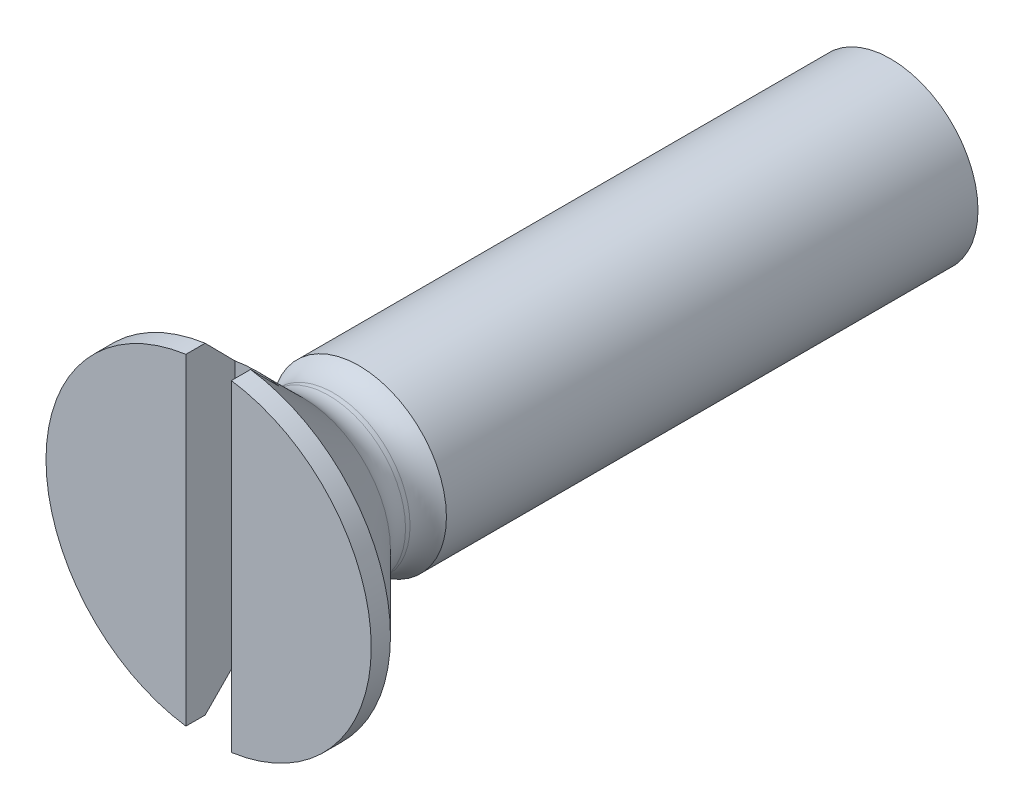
ISO-10303-21;
HEADER;
FILE_DESCRIPTION(('STEP AP214'),'2;1');
FILE_NAME('part.step','',(''),(''),'','','');
FILE_SCHEMA(('AUTOMOTIVE_DESIGN { 1 0 10303 214 1 1 1 1 }'));
ENDSEC;
DATA;
#1=APPLICATION_CONTEXT('core data for automotive mechanical design processes');
#2=APPLICATION_PROTOCOL_DEFINITION('international standard','automotive_design',2000,#1);
#3=PRODUCT_CONTEXT('',#1,'mechanical');
#4=PRODUCT('Part','Part','',(#3));
#5=PRODUCT_RELATED_PRODUCT_CATEGORY('part','',(#4));
#6=PRODUCT_DEFINITION_FORMATION('','',#4);
#7=PRODUCT_DEFINITION_CONTEXT('part definition',#1,'design');
#8=PRODUCT_DEFINITION('design','',#6,#7);
#9=PRODUCT_DEFINITION_SHAPE('','',#8);
#10=(LENGTH_UNIT() NAMED_UNIT(*) SI_UNIT(.MILLI.,.METRE.));
#11=(NAMED_UNIT(*) PLANE_ANGLE_UNIT() SI_UNIT($,.RADIAN.));
#12=(NAMED_UNIT(*) SI_UNIT($,.STERADIAN.) SOLID_ANGLE_UNIT());
#13=UNCERTAINTY_MEASURE_WITH_UNIT(LENGTH_MEASURE(1.E-05),#10,'distance_accuracy_value','');
#14=(GEOMETRIC_REPRESENTATION_CONTEXT(3) GLOBAL_UNCERTAINTY_ASSIGNED_CONTEXT((#13)) GLOBAL_UNIT_ASSIGNED_CONTEXT((#10,
#11,#12)) REPRESENTATION_CONTEXT('',''));
#15=CARTESIAN_POINT('',(0.,0.,0.));
#16=DIRECTION('',(0.,0.,1.));
#17=DIRECTION('',(1.,0.,0.));
#18=AXIS2_PLACEMENT_3D('',#15,#16,#17);
#19=CARTESIAN_POINT('',(0.,0.,0.));
#20=DIRECTION('',(0.,0.,1.));
#21=DIRECTION('',(1.,0.,0.));
#22=AXIS2_PLACEMENT_3D('',#19,#20,#21);
#23=CYLINDRICAL_SURFACE('',#22,2.5);
#24=CARTESIAN_POINT('',(0.,0.,-4.3));
#25=DIRECTION('',(0.,0.,1.));
#26=DIRECTION('',(1.,0.,0.));
#27=AXIS2_PLACEMENT_3D('',#24,#25,#26);
#28=CIRCLE('',#27,2.5);
#29=CARTESIAN_POINT('',(2.5,0.,-4.3));
#30=VERTEX_POINT('',#29);
#31=EDGE_CURVE('E108',#30,#30,#28,.T.);
#32=ORIENTED_EDGE('',*,*,#31,.F.);
#33=EDGE_LOOP('',(#32));
#34=FACE_BOUND('',#33,.T.);
#35=CARTESIAN_POINT('',(0.,0.,-19.5));
#36=DIRECTION('',(0.,0.,1.));
#37=DIRECTION('',(1.,0.,0.));
#38=AXIS2_PLACEMENT_3D('',#35,#36,#37);
#39=CIRCLE('',#38,2.5);
#40=CARTESIAN_POINT('',(2.5,0.,-19.5));
#41=VERTEX_POINT('',#40);
#42=EDGE_CURVE('E32',#41,#41,#39,.T.);
#43=ORIENTED_EDGE('',*,*,#42,.T.);
#44=EDGE_LOOP('',(#43));
#45=FACE_BOUND('',#44,.T.);
#46=ADVANCED_FACE('F29',(#34,#45),#23,.T.);
#47=CARTESIAN_POINT('',(0.,0.,0.));
#48=DIRECTION('',(0.,0.,1.));
#49=DIRECTION('',(1.,0.,0.));
#50=AXIS2_PLACEMENT_3D('',#47,#48,#49);
#51=CYLINDRICAL_SURFACE('',#50,4.65);
#52=CARTESIAN_POINT('',(0.,0.,-0.55));
#53=DIRECTION('',(0.,0.,1.));
#54=DIRECTION('',(1.,0.,0.));
#55=AXIS2_PLACEMENT_3D('',#52,#53,#54);
#56=CIRCLE('',#55,4.65);
#57=CARTESIAN_POINT('',(0.65,-4.60434577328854,-0.55));
#58=VERTEX_POINT('',#57);
#59=CARTESIAN_POINT('',(0.65,4.60434577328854,-0.55));
#60=VERTEX_POINT('',#59);
#61=EDGE_CURVE('E123',#58,#60,#56,.T.);
#62=ORIENTED_EDGE('',*,*,#61,.T.);
#63=DIRECTION('',(0.,0.,1.));
#64=VECTOR('',#63,1.);
#65=CARTESIAN_POINT('',(0.65,4.60434577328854,0.));
#66=LINE('',#65,#64);
#67=CARTESIAN_POINT('',(0.65,4.60434577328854,0.));
#68=VERTEX_POINT('',#67);
#69=EDGE_CURVE('E117',#60,#68,#66,.T.);
#70=ORIENTED_EDGE('',*,*,#69,.T.);
#71=CARTESIAN_POINT('',(0.,0.,0.));
#72=DIRECTION('',(0.,0.,1.));
#73=DIRECTION('',(1.,0.,0.));
#74=AXIS2_PLACEMENT_3D('',#71,#72,#73);
#75=CIRCLE('',#74,4.65);
#76=CARTESIAN_POINT('',(0.65,-4.60434577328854,0.));
#77=VERTEX_POINT('',#76);
#78=EDGE_CURVE('E102',#77,#68,#75,.T.);
#79=ORIENTED_EDGE('',*,*,#78,.F.);
#80=DIRECTION('',(0.,0.,1.));
#81=VECTOR('',#80,1.);
#82=CARTESIAN_POINT('',(0.65,-4.60434577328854,0.));
#83=LINE('',#82,#81);
#84=EDGE_CURVE('E109',#77,#58,#83,.F.);
#85=ORIENTED_EDGE('',*,*,#84,.T.);
#86=EDGE_LOOP('',(#62,#70,#79,#85));
#87=FACE_BOUND('',#86,.T.);
#88=ADVANCED_FACE('F169',(#87),#51,.T.);
#89=CARTESIAN_POINT('',(0.,4.65,0.));
#90=DIRECTION('',(0.,0.,-1.));
#91=DIRECTION('',(-1.,0.,0.));
#92=AXIS2_PLACEMENT_3D('',#89,#90,#91);
#93=PLANE('',#92);
#94=ORIENTED_EDGE('',*,*,#78,.T.);
#95=DIRECTION('',(0.,1.,0.));
#96=VECTOR('',#95,1.);
#97=CARTESIAN_POINT('',(0.65,0.,0.));
#98=LINE('',#97,#96);
#99=EDGE_CURVE('E103',#77,#68,#98,.T.);
#100=ORIENTED_EDGE('',*,*,#99,.F.);
#101=EDGE_LOOP('',(#94,#100));
#102=FACE_BOUND('',#101,.T.);
#103=ADVANCED_FACE('F174',(#102),#93,.F.);
#104=CARTESIAN_POINT('',(0.,0.,-3.56460894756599));
#105=DIRECTION('',(0.,0.,1.));
#106=DIRECTION('',(1.,0.,0.));
#107=AXIS2_PLACEMENT_3D('',#104,#105,#106);
#108=TOROIDAL_SURFACE('',#107,3.23539105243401,1.04);
#109=ORIENTED_EDGE('',*,*,#31,.T.);
#110=EDGE_LOOP('',(#109));
#111=FACE_BOUND('',#110,.T.);
#112=CARTESIAN_POINT('',(0.,0.,-3.56460894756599));
#113=DIRECTION('',(0.,0.,1.));
#114=DIRECTION('',(1.,0.,0.));
#115=AXIS2_PLACEMENT_3D('',#112,#113,#114);
#116=CIRCLE('',#115,2.19539105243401);
#117=CARTESIAN_POINT('',(2.19539105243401,0.,-3.56460894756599));
#118=VERTEX_POINT('',#117);
#119=EDGE_CURVE('E114',#118,#118,#116,.T.);
#120=ORIENTED_EDGE('',*,*,#119,.F.);
#121=EDGE_LOOP('',(#120));
#122=FACE_BOUND('',#121,.T.);
#123=ADVANCED_FACE('F177',(#111,#122),#108,.F.);
#124=CARTESIAN_POINT('',(0.,0.,0.));
#125=DIRECTION('',(0.,0.,1.));
#126=DIRECTION('',(1.,0.,0.));
#127=AXIS2_PLACEMENT_3D('',#124,#125,#126);
#128=CYLINDRICAL_SURFACE('',#127,2.19539105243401);
#129=CARTESIAN_POINT('',(0.,0.,-3.43539105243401));
#130=DIRECTION('',(0.,0.,1.));
#131=DIRECTION('',(1.,0.,0.));
#132=AXIS2_PLACEMENT_3D('',#129,#130,#131);
#133=CIRCLE('',#132,2.19539105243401);
#134=CARTESIAN_POINT('',(2.19539105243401,0.,-3.43539105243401));
#135=VERTEX_POINT('',#134);
#136=EDGE_CURVE('E185',#135,#135,#133,.T.);
#137=ORIENTED_EDGE('',*,*,#136,.F.);
#138=EDGE_LOOP('',(#137));
#139=FACE_BOUND('',#138,.T.);
#140=ORIENTED_EDGE('',*,*,#119,.T.);
#141=EDGE_LOOP('',(#140));
#142=FACE_BOUND('',#141,.T.);
#143=ADVANCED_FACE('F180',(#139,#142),#128,.T.);
#144=CARTESIAN_POINT('',(0.,0.,-3.43539105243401));
#145=DIRECTION('',(0.,0.,1.));
#146=DIRECTION('',(1.,0.,0.));
#147=AXIS2_PLACEMENT_3D('',#144,#145,#146);
#148=TOROIDAL_SURFACE('',#147,3.23539105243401,1.04);
#149=ORIENTED_EDGE('',*,*,#136,.T.);
#150=EDGE_LOOP('',(#149));
#151=FACE_BOUND('',#150,.T.);
#152=CARTESIAN_POINT('',(0.,0.,-2.7));
#153=DIRECTION('',(0.,0.,1.));
#154=DIRECTION('',(1.,0.,0.));
#155=AXIS2_PLACEMENT_3D('',#152,#153,#154);
#156=CIRCLE('',#155,2.5);
#157=CARTESIAN_POINT('',(2.5,0.,-2.7));
#158=VERTEX_POINT('',#157);
#159=EDGE_CURVE('E153',#158,#158,#156,.T.);
#160=ORIENTED_EDGE('',*,*,#159,.F.);
#161=EDGE_LOOP('',(#160));
#162=FACE_BOUND('',#161,.T.);
#163=ADVANCED_FACE('F206',(#151,#162),#148,.F.);
#164=CARTESIAN_POINT('',(0.,0.,-2.7));
#165=DIRECTION('',(0.,0.,1.));
#166=DIRECTION('',(1.,0.,0.));
#167=AXIS2_PLACEMENT_3D('',#164,#165,#166);
#168=CONICAL_SURFACE('',#167,2.5,0.785398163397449);
#169=CARTESIAN_POINT('',(0.,0.,-1.4));
#170=DIRECTION('',(0.,0.,-1.));
#171=DIRECTION('',(-1.,0.,0.));
#172=AXIS2_PLACEMENT_3D('',#169,#170,#171);
#173=CIRCLE('',#172,3.8);
#174=CARTESIAN_POINT('',(-0.65,3.74399519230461,-1.4));
#175=VERTEX_POINT('',#174);
#176=CARTESIAN_POINT('',(0.65,3.74399519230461,-1.4));
#177=VERTEX_POINT('',#176);
#178=EDGE_CURVE('E66',#175,#177,#173,.T.);
#179=ORIENTED_EDGE('',*,*,#178,.T.);
#180=CARTESIAN_POINT('',(0.65,0.538201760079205,-4.35610359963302));
#181=CARTESIAN_POINT('',(0.65,0.573240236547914,-4.33371533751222));
#182=CARTESIAN_POINT('',(0.65,0.607712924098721,-4.3104787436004));
#183=CARTESIAN_POINT('',(0.65,0.675727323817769,-4.26271560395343));
#184=CARTESIAN_POINT('',(0.65,0.709269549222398,-4.23818979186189));
#185=CARTESIAN_POINT('',(0.65,0.775616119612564,-4.1882637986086));
#186=CARTESIAN_POINT('',(0.65,0.808421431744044,-4.16286488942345));
#187=CARTESIAN_POINT('',(0.65,0.873494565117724,-4.11137844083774));
#188=CARTESIAN_POINT('',(0.65,0.905762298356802,-4.08529079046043));
#189=CARTESIAN_POINT('',(0.65,1.00182525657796,-4.00634415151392));
#190=CARTESIAN_POINT('',(0.65,1.06498862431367,-3.95271807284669));
#191=CARTESIAN_POINT('',(0.65,1.19024878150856,-3.84418842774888));
#192=CARTESIAN_POINT('',(0.65,1.2523450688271,-3.78928428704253));
#193=CARTESIAN_POINT('',(0.65,1.37448230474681,-3.67980771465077));
#194=CARTESIAN_POINT('',(0.65,1.43453896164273,-3.62525277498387));
#195=CARTESIAN_POINT('',(0.65,1.55413584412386,-3.51557906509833));
#196=CARTESIAN_POINT('',(0.65,1.6136760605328,-3.46046028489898));
#197=CARTESIAN_POINT('',(0.65,1.79173809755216,-3.29449341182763));
#198=CARTESIAN_POINT('',(0.65,1.90969532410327,-3.18304021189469));
#199=CARTESIAN_POINT('',(0.65,2.14472587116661,-2.95922198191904));
#200=CARTESIAN_POINT('',(0.65,2.26179923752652,-2.8468569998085));
#201=CARTESIAN_POINT('',(0.65,2.49537347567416,-2.62154161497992));
#202=CARTESIAN_POINT('',(0.65,2.6118743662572,-2.50859123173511));
#203=CARTESIAN_POINT('',(0.65,2.96138778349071,-2.16860578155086));
#204=CARTESIAN_POINT('',(0.65,3.19383459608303,-1.94098977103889));
#205=CARTESIAN_POINT('',(0.65,3.65795343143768,-1.48498706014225));
#206=CARTESIAN_POINT('',(0.65,3.88962548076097,-1.25660038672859));
#207=CARTESIAN_POINT('',(0.65,4.41135706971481,-0.741243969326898));
#208=CARTESIAN_POINT('',(0.65,4.70128636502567,-0.454142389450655));
#209=CARTESIAN_POINT('',(0.65,5.28074578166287,0.120470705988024));
#210=CARTESIAN_POINT('',(0.65,5.57027589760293,0.407982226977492));
#211=CARTESIAN_POINT('',(0.65,6.14807720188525,0.982259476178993));
#212=CARTESIAN_POINT('',(0.65,6.4363492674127,1.2690243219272));
#213=CARTESIAN_POINT('',(0.65,7.01271551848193,1.84272403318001));
#214=CARTESIAN_POINT('',(0.65,7.3008097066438,2.1296588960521));
#215=CARTESIAN_POINT('',(0.65,7.58885585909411,2.41664186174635));
#216=B_SPLINE_CURVE_WITH_KNOTS('',3,(#180,#181,#182,#183,#184,#185,#186,#187,#188,#189,#190,
#191,#192,#193,#194,#195,#196,#197,#198,#199,#200,#201,#202,#203,#204,#205,#206,#207,#208,#209,
#210,#211,#212,#213,#214,#215),.UNSPECIFIED.,.F.,.F.,(4,2,2,2,2,2,2,2,2,2,2,2,2,2,2,2,2,4),(0.,
0.124700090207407,0.249329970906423,0.373785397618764,0.498261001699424,0.74680216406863,
0.995457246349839,1.23885979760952,1.48226666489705,1.96910462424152,2.45591715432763,
2.94271359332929,3.91870361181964,4.89465982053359,6.11874095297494,7.34283844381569,
8.56268003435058,9.78250320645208),.UNSPECIFIED.);
#217=EDGE_CURVE('E191',#177,#60,#216,.T.);
#218=ORIENTED_EDGE('',*,*,#217,.T.);
#219=ORIENTED_EDGE('',*,*,#61,.F.);
#220=CARTESIAN_POINT('',(0.65,-7.58885585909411,2.41664186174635));
#221=CARTESIAN_POINT('',(0.65,-7.30024952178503,2.12909968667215));
#222=CARTESIAN_POINT('',(0.65,-7.01159415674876,1.84160665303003));
#223=CARTESIAN_POINT('',(0.65,-6.43413883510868,1.26682536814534));
#224=CARTESIAN_POINT('',(0.65,-6.14533889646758,0.979537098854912));
#225=CARTESIAN_POINT('',(0.65,-5.56757024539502,0.405293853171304));
#226=CARTESIAN_POINT('',(0.65,-5.27860160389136,0.118338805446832));
#227=CARTESIAN_POINT('',(0.65,-4.84482829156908,-0.311798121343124));
#228=CARTESIAN_POINT('',(0.65,-4.70017693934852,-0.455134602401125));
#229=CARTESIAN_POINT('',(0.65,-4.41073735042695,-0.741672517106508));
#230=CARTESIAN_POINT('',(0.65,-4.26594911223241,-0.884873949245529));
#231=CARTESIAN_POINT('',(0.65,-3.97610686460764,-1.17117694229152));
#232=CARTESIAN_POINT('',(0.65,-3.83105274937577,-1.31427839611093));
#233=CARTESIAN_POINT('',(0.65,-3.54069905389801,-1.60022064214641));
#234=CARTESIAN_POINT('',(0.65,-3.39539948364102,-1.74306144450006));
#235=CARTESIAN_POINT('',(0.65,-3.10448213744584,-2.02832926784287));
#236=CARTESIAN_POINT('',(0.65,-2.95886447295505,-2.17075640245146));
#237=CARTESIAN_POINT('',(0.65,-2.66706278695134,-2.45507201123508));
#238=CARTESIAN_POINT('',(0.65,-2.52087868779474,-2.59696040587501));
#239=CARTESIAN_POINT('',(0.65,-2.30085218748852,-2.80917333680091));
#240=CARTESIAN_POINT('',(0.65,-2.22734523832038,-2.87984553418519));
#241=CARTESIAN_POINT('',(0.65,-2.08003467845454,-3.02087432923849));
#242=CARTESIAN_POINT('',(0.65,-2.00623107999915,-3.09123093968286));
#243=CARTESIAN_POINT('',(0.65,-1.85825402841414,-3.23148501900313));
#244=CARTESIAN_POINT('',(0.65,-1.78408076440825,-3.30138268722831));
#245=CARTESIAN_POINT('',(0.65,-1.63515827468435,-3.44058565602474));
#246=CARTESIAN_POINT('',(0.65,-1.56040896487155,-3.50989086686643));
#247=CARTESIAN_POINT('',(0.65,-1.40996117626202,-3.64771822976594));
#248=CARTESIAN_POINT('',(0.65,-1.33426132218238,-3.71623888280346));
#249=CARTESIAN_POINT('',(0.65,-1.1816339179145,-3.85184853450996));
#250=CARTESIAN_POINT('',(0.65,-1.1047068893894,-3.91893811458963));
#251=CARTESIAN_POINT('',(0.65,-0.987685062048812,-4.01780122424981));
#252=CARTESIAN_POINT('',(0.65,-0.948366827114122,-4.05049134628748));
#253=CARTESIAN_POINT('',(0.65,-0.869042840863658,-4.11501141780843));
#254=CARTESIAN_POINT('',(0.65,-0.829037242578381,-4.14684155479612));
#255=CARTESIAN_POINT('',(0.65,-0.748033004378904,-4.20935058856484));
#256=CARTESIAN_POINT('',(0.65,-0.707032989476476,-4.24002772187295));
#257=CARTESIAN_POINT('',(0.65,-0.644558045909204,-4.28471634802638));
#258=CARTESIAN_POINT('',(0.65,-0.623562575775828,-4.29939659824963));
#259=CARTESIAN_POINT('',(0.65,-0.581185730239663,-4.32819868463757));
#260=CARTESIAN_POINT('',(0.65,-0.55980426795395,-4.3423203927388));
#261=CARTESIAN_POINT('',(0.65,-0.538201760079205,-4.35610359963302));
#262=B_SPLINE_CURVE_WITH_KNOTS('',3,(#220,#221,#222,#223,#224,#225,#226,#227,#228,#229,#230,
#231,#232,#233,#234,#235,#236,#237,#238,#239,#240,#241,#242,#243,#244,#245,#246,#247,#248,#249,
#250,#251,#252,#253,#254,#255,#256,#257,#258,#259,#260,#261),.UNSPECIFIED.,.F.,.F.,(4,2,2,2,2,2,
2,2,2,2,2,2,2,2,2,2,2,2,2,2,4),(0.,1.22219770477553,2.44426947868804,3.66599527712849,
4.27691602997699,4.88784352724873,5.49912763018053,6.1103874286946,6.72145947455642,
7.33261847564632,7.63852710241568,7.94442323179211,8.25017629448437,8.55597487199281,
8.86228353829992,9.16846529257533,9.32185514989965,9.47521128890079,9.62879315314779,
9.70564135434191,9.78250707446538),.UNSPECIFIED.);
#263=CARTESIAN_POINT('',(0.65,-3.74399519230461,-1.4));
#264=VERTEX_POINT('',#263);
#265=EDGE_CURVE('E127',#58,#264,#262,.T.);
#266=ORIENTED_EDGE('',*,*,#265,.T.);
#267=CARTESIAN_POINT('',(-0.65,-3.74399519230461,-1.4));
#268=VERTEX_POINT('',#267);
#269=EDGE_CURVE('E72',#264,#268,#173,.T.);
#270=ORIENTED_EDGE('',*,*,#269,.T.);
#271=CARTESIAN_POINT('',(-0.65,-0.538201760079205,-4.35610359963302));
#272=CARTESIAN_POINT('',(-0.65,-0.573240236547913,-4.33371533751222));
#273=CARTESIAN_POINT('',(-0.65,-0.607712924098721,-4.3104787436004));
#274=CARTESIAN_POINT('',(-0.65,-0.675727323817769,-4.26271560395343));
#275=CARTESIAN_POINT('',(-0.65,-0.709269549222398,-4.23818979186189));
#276=CARTESIAN_POINT('',(-0.65,-0.775616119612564,-4.1882637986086));
#277=CARTESIAN_POINT('',(-0.65,-0.808421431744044,-4.16286488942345));
#278=CARTESIAN_POINT('',(-0.65,-0.873494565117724,-4.11137844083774));
#279=CARTESIAN_POINT('',(-0.65,-0.905762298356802,-4.08529079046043));
#280=CARTESIAN_POINT('',(-0.65,-1.00182525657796,-4.00634415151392));
#281=CARTESIAN_POINT('',(-0.65,-1.06498862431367,-3.95271807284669));
#282=CARTESIAN_POINT('',(-0.65,-1.19024878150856,-3.84418842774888));
#283=CARTESIAN_POINT('',(-0.65,-1.2523450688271,-3.78928428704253));
#284=CARTESIAN_POINT('',(-0.65,-1.37448230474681,-3.67980771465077));
#285=CARTESIAN_POINT('',(-0.65,-1.43453896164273,-3.62525277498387));
#286=CARTESIAN_POINT('',(-0.65,-1.55413584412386,-3.51557906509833));
#287=CARTESIAN_POINT('',(-0.65,-1.6136760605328,-3.46046028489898));
#288=CARTESIAN_POINT('',(-0.65,-1.79173809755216,-3.29449341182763));
#289=CARTESIAN_POINT('',(-0.65,-1.90969532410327,-3.18304021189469));
#290=CARTESIAN_POINT('',(-0.65,-2.14472587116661,-2.95922198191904));
#291=CARTESIAN_POINT('',(-0.65,-2.26179923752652,-2.8468569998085));
#292=CARTESIAN_POINT('',(-0.65,-2.49537347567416,-2.62154161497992));
#293=CARTESIAN_POINT('',(-0.65,-2.6118743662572,-2.50859123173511));
#294=CARTESIAN_POINT('',(-0.65,-2.96138778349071,-2.16860578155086));
#295=CARTESIAN_POINT('',(-0.65,-3.19383459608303,-1.94098977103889));
#296=CARTESIAN_POINT('',(-0.65,-3.65795343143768,-1.48498706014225));
#297=CARTESIAN_POINT('',(-0.65,-3.88962548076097,-1.25660038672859));
#298=CARTESIAN_POINT('',(-0.65,-4.41135706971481,-0.741243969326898));
#299=CARTESIAN_POINT('',(-0.65,-4.70128636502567,-0.454142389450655));
#300=CARTESIAN_POINT('',(-0.65,-5.28074578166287,0.120470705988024));
#301=CARTESIAN_POINT('',(-0.65,-5.57027589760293,0.407982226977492));
#302=CARTESIAN_POINT('',(-0.65,-6.14807720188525,0.982259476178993));
#303=CARTESIAN_POINT('',(-0.65,-6.4363492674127,1.2690243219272));
#304=CARTESIAN_POINT('',(-0.65,-7.01271551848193,1.84272403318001));
#305=CARTESIAN_POINT('',(-0.65,-7.3008097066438,2.1296588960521));
#306=CARTESIAN_POINT('',(-0.65,-7.58885585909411,2.41664186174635));
#307=B_SPLINE_CURVE_WITH_KNOTS('',3,(#271,#272,#273,#274,#275,#276,#277,#278,#279,#280,#281,
#282,#283,#284,#285,#286,#287,#288,#289,#290,#291,#292,#293,#294,#295,#296,#297,#298,#299,#300,
#301,#302,#303,#304,#305,#306),.UNSPECIFIED.,.F.,.F.,(4,2,2,2,2,2,2,2,2,2,2,2,2,2,2,2,2,4),(0.,
0.124700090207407,0.249329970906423,0.373785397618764,0.498261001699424,0.74680216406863,
0.995457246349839,1.23885979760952,1.48226666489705,1.96910462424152,2.45591715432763,
2.94271359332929,3.91870361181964,4.89465982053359,6.11874095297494,7.34283844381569,
8.56268003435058,9.78250320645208),.UNSPECIFIED.);
#308=CARTESIAN_POINT('',(-0.65,-4.60434577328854,-0.55));
#309=VERTEX_POINT('',#308);
#310=EDGE_CURVE('E45',#268,#309,#307,.T.);
#311=ORIENTED_EDGE('',*,*,#310,.T.);
#312=CARTESIAN_POINT('',(-0.65,4.60434577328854,-0.55));
#313=VERTEX_POINT('',#312);
#314=EDGE_CURVE('E158',#313,#309,#56,.T.);
#315=ORIENTED_EDGE('',*,*,#314,.F.);
#316=CARTESIAN_POINT('',(-0.65,7.58885585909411,2.41664186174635));
#317=CARTESIAN_POINT('',(-0.65,7.30024952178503,2.12909968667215));
#318=CARTESIAN_POINT('',(-0.65,7.01159415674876,1.84160665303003));
#319=CARTESIAN_POINT('',(-0.65,6.43413883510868,1.26682536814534));
#320=CARTESIAN_POINT('',(-0.65,6.14533889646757,0.979537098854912));
#321=CARTESIAN_POINT('',(-0.65,5.56757024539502,0.405293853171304));
#322=CARTESIAN_POINT('',(-0.65,5.27860160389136,0.118338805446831));
#323=CARTESIAN_POINT('',(-0.65,4.84482829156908,-0.311798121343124));
#324=CARTESIAN_POINT('',(-0.65,4.70017693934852,-0.455134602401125));
#325=CARTESIAN_POINT('',(-0.65,4.41073735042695,-0.741672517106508));
#326=CARTESIAN_POINT('',(-0.65,4.26594911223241,-0.884873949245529));
#327=CARTESIAN_POINT('',(-0.65,3.97610686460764,-1.17117694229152));
#328=CARTESIAN_POINT('',(-0.65,3.83105274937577,-1.31427839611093));
#329=CARTESIAN_POINT('',(-0.65,3.54069905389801,-1.60022064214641));
#330=CARTESIAN_POINT('',(-0.65,3.39539948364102,-1.74306144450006));
#331=CARTESIAN_POINT('',(-0.65,3.10448213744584,-2.02832926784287));
#332=CARTESIAN_POINT('',(-0.65,2.95886447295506,-2.17075640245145));
#333=CARTESIAN_POINT('',(-0.65,2.66706278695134,-2.45507201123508));
#334=CARTESIAN_POINT('',(-0.65,2.52087868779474,-2.59696040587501));
#335=CARTESIAN_POINT('',(-0.65,2.30085218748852,-2.80917333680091));
#336=CARTESIAN_POINT('',(-0.65,2.22734523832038,-2.87984553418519));
#337=CARTESIAN_POINT('',(-0.65,2.08003467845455,-3.02087432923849));
#338=CARTESIAN_POINT('',(-0.65,2.00623107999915,-3.09123093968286));
#339=CARTESIAN_POINT('',(-0.65,1.85825402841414,-3.23148501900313));
#340=CARTESIAN_POINT('',(-0.65,1.78408076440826,-3.30138268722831));
#341=CARTESIAN_POINT('',(-0.65,1.63515827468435,-3.44058565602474));
#342=CARTESIAN_POINT('',(-0.65,1.56040896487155,-3.50989086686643));
#343=CARTESIAN_POINT('',(-0.65,1.40996117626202,-3.64771822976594));
#344=CARTESIAN_POINT('',(-0.65,1.33426132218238,-3.71623888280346));
#345=CARTESIAN_POINT('',(-0.65,1.1816339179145,-3.85184853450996));
#346=CARTESIAN_POINT('',(-0.65,1.10470688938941,-3.91893811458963));
#347=CARTESIAN_POINT('',(-0.65,0.987685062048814,-4.0178012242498));
#348=CARTESIAN_POINT('',(-0.65,0.948366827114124,-4.05049134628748));
#349=CARTESIAN_POINT('',(-0.65,0.869042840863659,-4.11501141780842));
#350=CARTESIAN_POINT('',(-0.65,0.829037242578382,-4.14684155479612));
#351=CARTESIAN_POINT('',(-0.65,0.748033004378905,-4.20935058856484));
#352=CARTESIAN_POINT('',(-0.65,0.707032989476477,-4.24002772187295));
#353=CARTESIAN_POINT('',(-0.65,0.644558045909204,-4.28471634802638));
#354=CARTESIAN_POINT('',(-0.65,0.623562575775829,-4.29939659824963));
#355=CARTESIAN_POINT('',(-0.65,0.581185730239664,-4.32819868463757));
#356=CARTESIAN_POINT('',(-0.65,0.55980426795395,-4.3423203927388));
#357=CARTESIAN_POINT('',(-0.65,0.538201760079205,-4.35610359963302));
#358=B_SPLINE_CURVE_WITH_KNOTS('',3,(#316,#317,#318,#319,#320,#321,#322,#323,#324,#325,#326,
#327,#328,#329,#330,#331,#332,#333,#334,#335,#336,#337,#338,#339,#340,#341,#342,#343,#344,#345,
#346,#347,#348,#349,#350,#351,#352,#353,#354,#355,#356,#357),.UNSPECIFIED.,.F.,.F.,(4,2,2,2,2,2,
2,2,2,2,2,2,2,2,2,2,2,2,2,2,4),(0.,1.22219770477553,2.44426947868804,3.66599527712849,
4.276916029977,4.88784352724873,5.49912763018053,6.1103874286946,6.72145947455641,
7.33261847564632,7.63852710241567,7.9444232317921,8.25017629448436,8.5559748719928,
8.86228353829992,9.16846529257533,9.32185514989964,9.47521128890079,9.62879315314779,
9.70564135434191,9.78250707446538),.UNSPECIFIED.);
#359=EDGE_CURVE('E89',#313,#175,#358,.T.);
#360=ORIENTED_EDGE('',*,*,#359,.T.);
#361=EDGE_LOOP('',(#179,#218,#219,#266,#270,#311,#315,#360));
#362=FACE_BOUND('',#361,.T.);
#363=ORIENTED_EDGE('',*,*,#159,.T.);
#364=EDGE_LOOP('',(#363));
#365=FACE_BOUND('',#364,.T.);
#366=ADVANCED_FACE('F139',(#362,#365),#168,.T.);
#367=ORIENTED_EDGE('',*,*,#314,.T.);
#368=DIRECTION('',(0.,0.,1.));
#369=VECTOR('',#368,1.);
#370=CARTESIAN_POINT('',(-0.65,-4.60434577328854,0.));
#371=LINE('',#370,#369);
#372=CARTESIAN_POINT('',(-0.65,-4.60434577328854,0.));
#373=VERTEX_POINT('',#372);
#374=EDGE_CURVE('E50',#309,#373,#371,.T.);
#375=ORIENTED_EDGE('',*,*,#374,.T.);
#376=CARTESIAN_POINT('',(-0.65,4.60434577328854,0.));
#377=VERTEX_POINT('',#376);
#378=EDGE_CURVE('E94',#377,#373,#75,.T.);
#379=ORIENTED_EDGE('',*,*,#378,.F.);
#380=DIRECTION('',(0.,0.,1.));
#381=VECTOR('',#380,1.);
#382=CARTESIAN_POINT('',(-0.65,4.60434577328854,0.));
#383=LINE('',#382,#381);
#384=EDGE_CURVE('E85',#377,#313,#383,.F.);
#385=ORIENTED_EDGE('',*,*,#384,.T.);
#386=EDGE_LOOP('',(#367,#375,#379,#385));
#387=FACE_BOUND('',#386,.T.);
#388=ADVANCED_FACE('F99',(#387),#51,.T.);
#389=ORIENTED_EDGE('',*,*,#378,.T.);
#390=DIRECTION('',(0.,-1.,0.));
#391=VECTOR('',#390,1.);
#392=CARTESIAN_POINT('',(-0.65,0.,0.));
#393=LINE('',#392,#391);
#394=EDGE_CURVE('E11',#377,#373,#393,.T.);
#395=ORIENTED_EDGE('',*,*,#394,.F.);
#396=EDGE_LOOP('',(#389,#395));
#397=FACE_BOUND('',#396,.T.);
#398=ADVANCED_FACE('F98',(#397),#93,.F.);
#399=CARTESIAN_POINT('',(-0.65,0.,-1.4));
#400=DIRECTION('',(0.,0.,-1.));
#401=DIRECTION('',(-1.,0.,0.));
#402=AXIS2_PLACEMENT_3D('',#399,#400,#401);
#403=PLANE('',#402);
#404=DIRECTION('',(0.,1.,0.));
#405=VECTOR('',#404,1.);
#406=CARTESIAN_POINT('',(-0.65,0.,-1.4));
#407=LINE('',#406,#405);
#408=EDGE_CURVE('E37',#268,#175,#407,.T.);
#409=ORIENTED_EDGE('',*,*,#408,.F.);
#410=ORIENTED_EDGE('',*,*,#269,.F.);
#411=DIRECTION('',(0.,-1.,0.));
#412=VECTOR('',#411,1.);
#413=CARTESIAN_POINT('',(0.65,0.,-1.4));
#414=LINE('',#413,#412);
#415=EDGE_CURVE('E100',#177,#264,#414,.T.);
#416=ORIENTED_EDGE('',*,*,#415,.F.);
#417=ORIENTED_EDGE('',*,*,#178,.F.);
#418=EDGE_LOOP('',(#409,#410,#416,#417));
#419=FACE_BOUND('',#418,.T.);
#420=ADVANCED_FACE('F148',(#419),#403,.F.);
#421=CARTESIAN_POINT('',(0.65,0.,-0.7));
#422=DIRECTION('',(1.,0.,0.));
#423=DIRECTION('',(0.,0.,-1.));
#424=AXIS2_PLACEMENT_3D('',#421,#422,#423);
#425=PLANE('',#424);
#426=ORIENTED_EDGE('',*,*,#415,.T.);
#427=ORIENTED_EDGE('',*,*,#265,.F.);
#428=ORIENTED_EDGE('',*,*,#84,.F.);
#429=ORIENTED_EDGE('',*,*,#99,.T.);
#430=ORIENTED_EDGE('',*,*,#69,.F.);
#431=ORIENTED_EDGE('',*,*,#217,.F.);
#432=EDGE_LOOP('',(#426,#427,#428,#429,#430,#431));
#433=FACE_BOUND('',#432,.T.);
#434=ADVANCED_FACE('F147',(#433),#425,.F.);
#435=CARTESIAN_POINT('',(-0.65,0.,-0.7));
#436=DIRECTION('',(-1.,0.,0.));
#437=DIRECTION('',(0.,0.,1.));
#438=AXIS2_PLACEMENT_3D('',#435,#436,#437);
#439=PLANE('',#438);
#440=ORIENTED_EDGE('',*,*,#408,.T.);
#441=ORIENTED_EDGE('',*,*,#359,.F.);
#442=ORIENTED_EDGE('',*,*,#384,.F.);
#443=ORIENTED_EDGE('',*,*,#394,.T.);
#444=ORIENTED_EDGE('',*,*,#374,.F.);
#445=ORIENTED_EDGE('',*,*,#310,.F.);
#446=EDGE_LOOP('',(#440,#441,#442,#443,#444,#445));
#447=FACE_BOUND('',#446,.T.);
#448=ADVANCED_FACE('F87',(#447),#439,.F.);
#449=CARTESIAN_POINT('',(0.,2.5,-19.5));
#450=DIRECTION('',(0.,0.,-1.));
#451=DIRECTION('',(-1.,0.,0.));
#452=AXIS2_PLACEMENT_3D('',#449,#450,#451);
#453=PLANE('',#452);
#454=ORIENTED_EDGE('',*,*,#42,.F.);
#455=EDGE_LOOP('',(#454));
#456=FACE_BOUND('',#455,.T.);
#457=ADVANCED_FACE('F146',(#456),#453,.T.);
#458=CLOSED_SHELL('',(#46,#88,#103,#123,#143,#163,#366,#388,#398,#420,#434,#448,#457));
#459=MANIFOLD_SOLID_BREP('B2',#458);
#460=ADVANCED_BREP_SHAPE_REPRESENTATION('',(#18,#459),#14);
#461=SHAPE_DEFINITION_REPRESENTATION(#9,#460);
ENDSEC;
END-ISO-10303-21;
